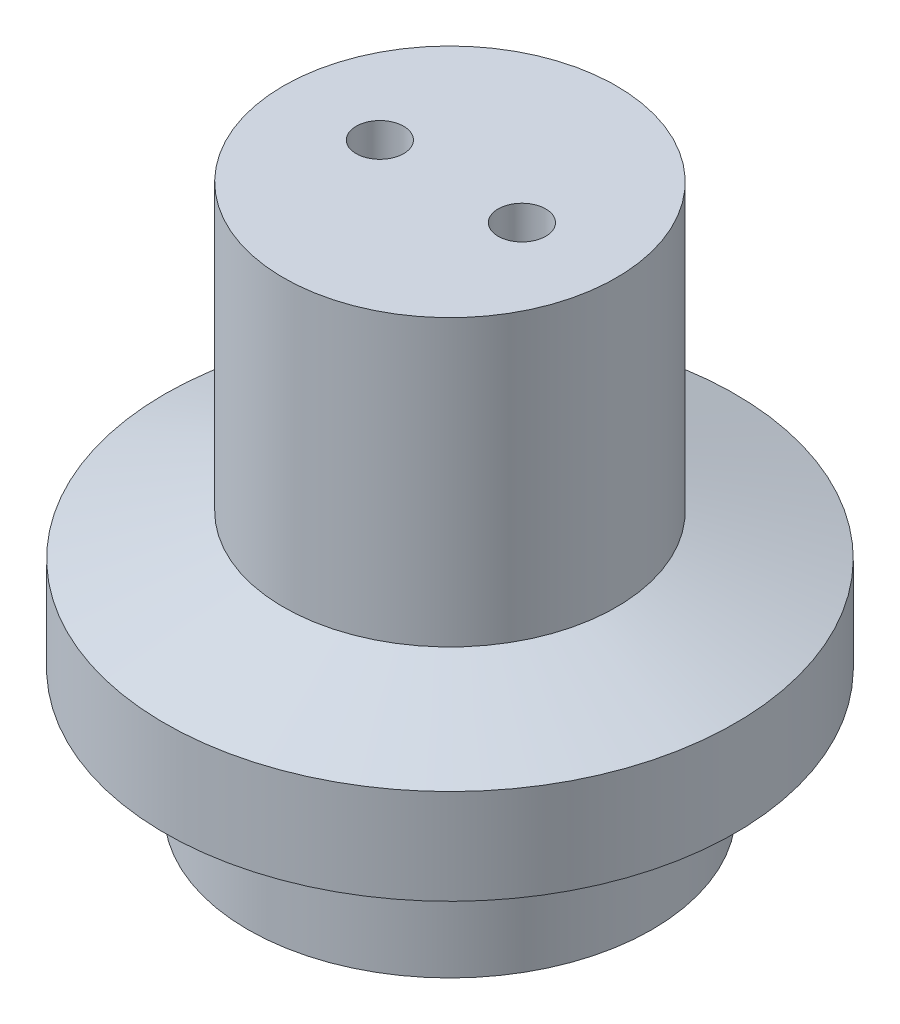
ISO-10303-21;
HEADER;
FILE_DESCRIPTION(('STEP AP214'),'2;1');
FILE_NAME('part.step','',(''),(''),'','','');
FILE_SCHEMA(('AUTOMOTIVE_DESIGN { 1 0 10303 214 1 1 1 1 }'));
ENDSEC;
DATA;
#1=APPLICATION_CONTEXT('core data for automotive mechanical design processes');
#2=APPLICATION_PROTOCOL_DEFINITION('international standard','automotive_design',2000,#1);
#3=PRODUCT_CONTEXT('',#1,'mechanical');
#4=PRODUCT('Part','Part','',(#3));
#5=PRODUCT_RELATED_PRODUCT_CATEGORY('part','',(#4));
#6=PRODUCT_DEFINITION_FORMATION('','',#4);
#7=PRODUCT_DEFINITION_CONTEXT('part definition',#1,'design');
#8=PRODUCT_DEFINITION('design','',#6,#7);
#9=PRODUCT_DEFINITION_SHAPE('','',#8);
#10=(LENGTH_UNIT() NAMED_UNIT(*) SI_UNIT(.MILLI.,.METRE.));
#11=(NAMED_UNIT(*) PLANE_ANGLE_UNIT() SI_UNIT($,.RADIAN.));
#12=(NAMED_UNIT(*) SI_UNIT($,.STERADIAN.) SOLID_ANGLE_UNIT());
#13=UNCERTAINTY_MEASURE_WITH_UNIT(LENGTH_MEASURE(1.E-05),#10,'distance_accuracy_value','');
#14=(GEOMETRIC_REPRESENTATION_CONTEXT(3) GLOBAL_UNCERTAINTY_ASSIGNED_CONTEXT((#13)) GLOBAL_UNIT_ASSIGNED_CONTEXT((#10,
#11,#12)) REPRESENTATION_CONTEXT('',''));
#15=CARTESIAN_POINT('',(0.,0.,0.));
#16=DIRECTION('',(0.,0.,1.));
#17=DIRECTION('',(1.,0.,0.));
#18=AXIS2_PLACEMENT_3D('',#15,#16,#17);
#19=CARTESIAN_POINT('',(-26.1681552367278,15.8462912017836,0.));
#20=DIRECTION('',(0.,1.,0.));
#21=DIRECTION('',(-1.,0.,0.));
#22=AXIS2_PLACEMENT_3D('',#19,#20,#21);
#23=CYLINDRICAL_SURFACE('',#22,3.5);
#24=CARTESIAN_POINT('',(-26.1681552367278,19.8462912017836,0.));
#25=DIRECTION('',(0.,1.,0.));
#26=DIRECTION('',(-1.,0.,0.));
#27=AXIS2_PLACEMENT_3D('',#24,#25,#26);
#28=CIRCLE('',#27,3.5);
#29=CARTESIAN_POINT('',(-29.6681552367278,19.8462912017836,0.));
#30=VERTEX_POINT('',#29);
#31=EDGE_CURVE('E55',#30,#30,#28,.T.);
#32=ORIENTED_EDGE('',*,*,#31,.T.);
#33=EDGE_LOOP('',(#32));
#34=FACE_BOUND('',#33,.T.);
#35=CARTESIAN_POINT('',(-26.1681552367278,15.8462912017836,0.));
#36=DIRECTION('',(0.,1.,0.));
#37=DIRECTION('',(-1.,0.,0.));
#38=AXIS2_PLACEMENT_3D('',#35,#36,#37);
#39=CIRCLE('',#38,3.5);
#40=CARTESIAN_POINT('',(-29.6681552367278,15.8462912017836,0.));
#41=VERTEX_POINT('',#40);
#42=EDGE_CURVE('E19',#41,#41,#39,.T.);
#43=ORIENTED_EDGE('',*,*,#42,.F.);
#44=EDGE_LOOP('',(#43));
#45=FACE_BOUND('',#44,.T.);
#46=ADVANCED_FACE('F15',(#34,#45),#23,.F.);
#47=CARTESIAN_POINT('',(-28.2931552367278,15.8462912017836,0.));
#48=DIRECTION('',(0.,-1.,0.));
#49=DIRECTION('',(1.,0.,0.));
#50=AXIS2_PLACEMENT_3D('',#47,#48,#49);
#51=PLANE('',#50);
#52=ORIENTED_EDGE('',*,*,#42,.T.);
#53=EDGE_LOOP('',(#52));
#54=FACE_BOUND('',#53,.T.);
#55=CARTESIAN_POINT('',(-26.1681552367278,15.8462912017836,0.));
#56=DIRECTION('',(0.,1.,0.));
#57=DIRECTION('',(-1.,0.,0.));
#58=AXIS2_PLACEMENT_3D('',#55,#56,#57);
#59=CIRCLE('',#58,4.25000000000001);
#60=CARTESIAN_POINT('',(-30.4181552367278,15.8462912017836,0.));
#61=VERTEX_POINT('',#60);
#62=EDGE_CURVE('E53',#61,#61,#59,.T.);
#63=ORIENTED_EDGE('',*,*,#62,.F.);
#64=EDGE_LOOP('',(#63));
#65=FACE_BOUND('',#64,.T.);
#66=ADVANCED_FACE('F62',(#54,#65),#51,.T.);
#67=CARTESIAN_POINT('',(-26.1681552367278,19.8462912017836,0.));
#68=DIRECTION('',(0.,1.,0.));
#69=DIRECTION('',(0.,0.,1.));
#70=AXIS2_PLACEMENT_3D('',#67,#68,#69);
#71=PLANE('',#70);
#72=ORIENTED_EDGE('',*,*,#31,.F.);
#73=EDGE_LOOP('',(#72));
#74=FACE_BOUND('',#73,.T.);
#75=CARTESIAN_POINT('',(-26.1681552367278,19.8462912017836,0.));
#76=DIRECTION('',(0.,1.,0.));
#77=DIRECTION('',(-1.,0.,0.));
#78=AXIS2_PLACEMENT_3D('',#75,#76,#77);
#79=CIRCLE('',#78,3.);
#80=CARTESIAN_POINT('',(-29.1681552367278,19.8462912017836,0.));
#81=VERTEX_POINT('',#80);
#82=EDGE_CURVE('E50',#81,#81,#79,.F.);
#83=ORIENTED_EDGE('',*,*,#82,.F.);
#84=EDGE_LOOP('',(#83));
#85=FACE_BOUND('',#84,.T.);
#86=ADVANCED_FACE('F71',(#74,#85),#71,.F.);
#87=CARTESIAN_POINT('',(-26.1681552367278,16.6580970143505,0.));
#88=DIRECTION('',(0.,1.,0.));
#89=DIRECTION('',(-1.,0.,0.));
#90=AXIS2_PLACEMENT_3D('',#87,#88,#89);
#91=CYLINDRICAL_SURFACE('',#90,4.25000000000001);
#92=ORIENTED_EDGE('',*,*,#62,.T.);
#93=EDGE_LOOP('',(#92));
#94=FACE_BOUND('',#93,.T.);
#95=CARTESIAN_POINT('',(-26.1681552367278,17.4699028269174,0.));
#96=DIRECTION('',(0.,1.,0.));
#97=DIRECTION('',(-1.,0.,0.));
#98=AXIS2_PLACEMENT_3D('',#95,#96,#97);
#99=CIRCLE('',#98,4.24999999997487);
#100=CARTESIAN_POINT('',(-30.4181552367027,17.4699028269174,0.));
#101=VERTEX_POINT('',#100);
#102=EDGE_CURVE('E32',#101,#101,#99,.T.);
#103=ORIENTED_EDGE('',*,*,#102,.F.);
#104=EDGE_LOOP('',(#103));
#105=FACE_BOUND('',#104,.T.);
#106=ADVANCED_FACE('F113',(#94,#105),#91,.T.);
#107=CARTESIAN_POINT('',(-26.1681552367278,15.8462912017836,0.));
#108=DIRECTION('',(0.,1.,0.));
#109=DIRECTION('',(-1.,0.,0.));
#110=AXIS2_PLACEMENT_3D('',#107,#108,#109);
#111=CYLINDRICAL_SURFACE('',#110,3.);
#112=ORIENTED_EDGE('',*,*,#82,.T.);
#113=EDGE_LOOP('',(#112));
#114=FACE_BOUND('',#113,.T.);
#115=CARTESIAN_POINT('',(-26.1681552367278,15.8462912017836,0.));
#116=DIRECTION('',(0.,1.,0.));
#117=DIRECTION('',(-1.,0.,0.));
#118=AXIS2_PLACEMENT_3D('',#115,#116,#117);
#119=CIRCLE('',#118,3.);
#120=CARTESIAN_POINT('',(-29.1681552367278,15.8462912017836,0.));
#121=VERTEX_POINT('',#120);
#122=EDGE_CURVE('E47',#121,#121,#119,.F.);
#123=ORIENTED_EDGE('',*,*,#122,.F.);
#124=EDGE_LOOP('',(#123));
#125=FACE_BOUND('',#124,.T.);
#126=ADVANCED_FACE('F109',(#114,#125),#111,.T.);
#127=CARTESIAN_POINT('',(-26.1681552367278,18.4802657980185,0.));
#128=DIRECTION('',(0.,1.,0.));
#129=DIRECTION('',(-1.,0.,0.));
#130=AXIS2_PLACEMENT_3D('',#127,#128,#129);
#131=CONICAL_SURFACE('',#130,6.00000000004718,1.04719755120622);
#132=ORIENTED_EDGE('',*,*,#102,.T.);
#133=EDGE_LOOP('',(#132));
#134=FACE_BOUND('',#133,.T.);
#135=CARTESIAN_POINT('',(-26.1681552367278,18.4802657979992,0.));
#136=DIRECTION('',(0.,1.,0.));
#137=DIRECTION('',(-1.,0.,0.));
#138=AXIS2_PLACEMENT_3D('',#135,#136,#137);
#139=CIRCLE('',#138,6.);
#140=CARTESIAN_POINT('',(-32.1681552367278,18.4802657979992,0.));
#141=VERTEX_POINT('',#140);
#142=EDGE_CURVE('E46',#141,#141,#139,.T.);
#143=ORIENTED_EDGE('',*,*,#142,.F.);
#144=EDGE_LOOP('',(#143));
#145=FACE_BOUND('',#144,.T.);
#146=ADVANCED_FACE('F105',(#134,#145),#131,.T.);
#147=CARTESIAN_POINT('',(-28.2931552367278,15.8462912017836,0.));
#148=DIRECTION('',(0.,-1.,0.));
#149=DIRECTION('',(1.,0.,0.));
#150=AXIS2_PLACEMENT_3D('',#147,#148,#149);
#151=PLANE('',#150);
#152=CARTESIAN_POINT('',(-24.6681552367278,15.8462912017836,-0.0146156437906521));
#153=DIRECTION('',(0.,-1.,0.));
#154=DIRECTION('',(1.,0.,0.));
#155=AXIS2_PLACEMENT_3D('',#152,#153,#154);
#156=CIRCLE('',#155,0.5);
#157=CARTESIAN_POINT('',(-24.1681552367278,15.8462912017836,-0.0146156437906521));
#158=VERTEX_POINT('',#157);
#159=EDGE_CURVE('E40',#158,#158,#156,.F.);
#160=ORIENTED_EDGE('',*,*,#159,.T.);
#161=EDGE_LOOP('',(#160));
#162=FACE_BOUND('',#161,.T.);
#163=CARTESIAN_POINT('',(-27.6681552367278,15.8462912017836,-0.026383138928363));
#164=DIRECTION('',(0.,-1.,0.));
#165=DIRECTION('',(1.,0.,0.));
#166=AXIS2_PLACEMENT_3D('',#163,#164,#165);
#167=CIRCLE('',#166,0.5);
#168=CARTESIAN_POINT('',(-27.1681552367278,15.8462912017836,-0.026383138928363));
#169=VERTEX_POINT('',#168);
#170=EDGE_CURVE('E43',#169,#169,#167,.F.);
#171=ORIENTED_EDGE('',*,*,#170,.T.);
#172=EDGE_LOOP('',(#171));
#173=FACE_BOUND('',#172,.T.);
#174=ORIENTED_EDGE('',*,*,#122,.T.);
#175=EDGE_LOOP('',(#174));
#176=FACE_BOUND('',#175,.T.);
#177=ADVANCED_FACE('F101',(#162,#173,#176),#151,.T.);
#178=CARTESIAN_POINT('',(-26.1681552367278,19.4802657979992,0.));
#179=DIRECTION('',(0.,1.,0.));
#180=DIRECTION('',(-1.,0.,0.));
#181=AXIS2_PLACEMENT_3D('',#178,#179,#180);
#182=CYLINDRICAL_SURFACE('',#181,6.);
#183=ORIENTED_EDGE('',*,*,#142,.T.);
#184=EDGE_LOOP('',(#183));
#185=FACE_BOUND('',#184,.T.);
#186=CARTESIAN_POINT('',(-26.1681552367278,20.4802657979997,0.));
#187=DIRECTION('',(0.,-1.,0.));
#188=DIRECTION('',(-1.,0.,0.));
#189=AXIS2_PLACEMENT_3D('',#186,#187,#188);
#190=CIRCLE('',#189,5.99999999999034);
#191=CARTESIAN_POINT('',(-32.1681552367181,20.4802657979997,0.));
#192=VERTEX_POINT('',#191);
#193=EDGE_CURVE('E39',#192,#192,#190,.F.);
#194=ORIENTED_EDGE('',*,*,#193,.F.);
#195=EDGE_LOOP('',(#194));
#196=FACE_BOUND('',#195,.T.);
#197=ADVANCED_FACE('F97',(#185,#196),#182,.T.);
#198=CARTESIAN_POINT('',(-27.6681552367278,36.3462912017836,-0.026383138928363));
#199=DIRECTION('',(0.,-1.,0.));
#200=DIRECTION('',(1.,0.,0.));
#201=AXIS2_PLACEMENT_3D('',#198,#199,#200);
#202=CYLINDRICAL_SURFACE('',#201,0.5);
#203=ORIENTED_EDGE('',*,*,#170,.F.);
#204=EDGE_LOOP('',(#203));
#205=FACE_BOUND('',#204,.T.);
#206=CARTESIAN_POINT('',(-27.6681552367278,27.3462912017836,-0.026383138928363));
#207=DIRECTION('',(0.,-1.,0.));
#208=DIRECTION('',(1.,0.,0.));
#209=AXIS2_PLACEMENT_3D('',#206,#207,#208);
#210=CIRCLE('',#209,0.5);
#211=CARTESIAN_POINT('',(-27.1681552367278,27.3462912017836,-0.026383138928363));
#212=VERTEX_POINT('',#211);
#213=EDGE_CURVE('E36',#212,#212,#210,.T.);
#214=ORIENTED_EDGE('',*,*,#213,.F.);
#215=EDGE_LOOP('',(#214));
#216=FACE_BOUND('',#215,.T.);
#217=ADVANCED_FACE('F90',(#205,#216),#202,.F.);
#218=CARTESIAN_POINT('',(-24.6681552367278,36.3462912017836,-0.0146156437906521));
#219=DIRECTION('',(0.,-1.,0.));
#220=DIRECTION('',(1.,0.,0.));
#221=AXIS2_PLACEMENT_3D('',#218,#219,#220);
#222=CYLINDRICAL_SURFACE('',#221,0.5);
#223=ORIENTED_EDGE('',*,*,#159,.F.);
#224=EDGE_LOOP('',(#223));
#225=FACE_BOUND('',#224,.T.);
#226=CARTESIAN_POINT('',(-24.6681552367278,27.3462912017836,-0.0146156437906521));
#227=DIRECTION('',(0.,-1.,0.));
#228=DIRECTION('',(1.,0.,0.));
#229=AXIS2_PLACEMENT_3D('',#226,#227,#228);
#230=CIRCLE('',#229,0.5);
#231=CARTESIAN_POINT('',(-24.1681552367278,27.3462912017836,-0.0146156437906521));
#232=VERTEX_POINT('',#231);
#233=EDGE_CURVE('E28',#232,#232,#230,.T.);
#234=ORIENTED_EDGE('',*,*,#233,.F.);
#235=EDGE_LOOP('',(#234));
#236=FACE_BOUND('',#235,.T.);
#237=ADVANCED_FACE('F84',(#225,#236),#222,.F.);
#238=CARTESIAN_POINT('',(-26.1681552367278,20.4802657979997,0.));
#239=DIRECTION('',(0.,-1.,0.));
#240=DIRECTION('',(1.,0.,0.));
#241=AXIS2_PLACEMENT_3D('',#238,#239,#240);
#242=CONICAL_SURFACE('',#241,5.99999999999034,1.23732315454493);
#243=ORIENTED_EDGE('',*,*,#193,.T.);
#244=EDGE_LOOP('',(#243));
#245=FACE_BOUND('',#244,.T.);
#246=CARTESIAN_POINT('',(-26.1681552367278,21.3462912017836,0.));
#247=DIRECTION('',(0.,1.,0.));
#248=DIRECTION('',(-1.,0.,0.));
#249=AXIS2_PLACEMENT_3D('',#246,#247,#248);
#250=CIRCLE('',#249,3.5);
#251=CARTESIAN_POINT('',(-29.6681552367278,21.3462912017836,0.));
#252=VERTEX_POINT('',#251);
#253=EDGE_CURVE('E23',#252,#252,#250,.T.);
#254=ORIENTED_EDGE('',*,*,#253,.F.);
#255=EDGE_LOOP('',(#254));
#256=FACE_BOUND('',#255,.T.);
#257=ADVANCED_FACE('F79',(#245,#256),#242,.T.);
#258=CARTESIAN_POINT('',(-27.9181552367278,27.3462912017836,0.));
#259=DIRECTION('',(0.,1.,0.));
#260=DIRECTION('',(0.,0.,1.));
#261=AXIS2_PLACEMENT_3D('',#258,#259,#260);
#262=PLANE('',#261);
#263=CARTESIAN_POINT('',(-26.1681552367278,27.3462912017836,0.));
#264=DIRECTION('',(0.,1.,0.));
#265=DIRECTION('',(-1.,0.,0.));
#266=AXIS2_PLACEMENT_3D('',#263,#264,#265);
#267=CIRCLE('',#266,3.5);
#268=CARTESIAN_POINT('',(-29.6681552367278,27.3462912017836,0.));
#269=VERTEX_POINT('',#268);
#270=EDGE_CURVE('E10',#269,#269,#267,.F.);
#271=ORIENTED_EDGE('',*,*,#270,.F.);
#272=EDGE_LOOP('',(#271));
#273=FACE_BOUND('',#272,.T.);
#274=ORIENTED_EDGE('',*,*,#233,.T.);
#275=EDGE_LOOP('',(#274));
#276=FACE_BOUND('',#275,.T.);
#277=ORIENTED_EDGE('',*,*,#213,.T.);
#278=EDGE_LOOP('',(#277));
#279=FACE_BOUND('',#278,.T.);
#280=ADVANCED_FACE('F74',(#273,#276,#279),#262,.T.);
#281=CARTESIAN_POINT('',(-26.1681552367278,24.3462912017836,0.));
#282=DIRECTION('',(0.,1.,0.));
#283=DIRECTION('',(-1.,0.,0.));
#284=AXIS2_PLACEMENT_3D('',#281,#282,#283);
#285=CYLINDRICAL_SURFACE('',#284,3.5);
#286=ORIENTED_EDGE('',*,*,#253,.T.);
#287=EDGE_LOOP('',(#286));
#288=FACE_BOUND('',#287,.T.);
#289=ORIENTED_EDGE('',*,*,#270,.T.);
#290=EDGE_LOOP('',(#289));
#291=FACE_BOUND('',#290,.T.);
#292=ADVANCED_FACE('F17',(#288,#291),#285,.T.);
#293=CLOSED_SHELL('',(#46,#66,#86,#106,#126,#146,#177,#197,#217,#237,#257,#280,#292));
#294=MANIFOLD_SOLID_BREP('B1',#293);
#295=ADVANCED_BREP_SHAPE_REPRESENTATION('',(#18,#294),#14);
#296=SHAPE_DEFINITION_REPRESENTATION(#9,#295);
ENDSEC;
END-ISO-10303-21;
